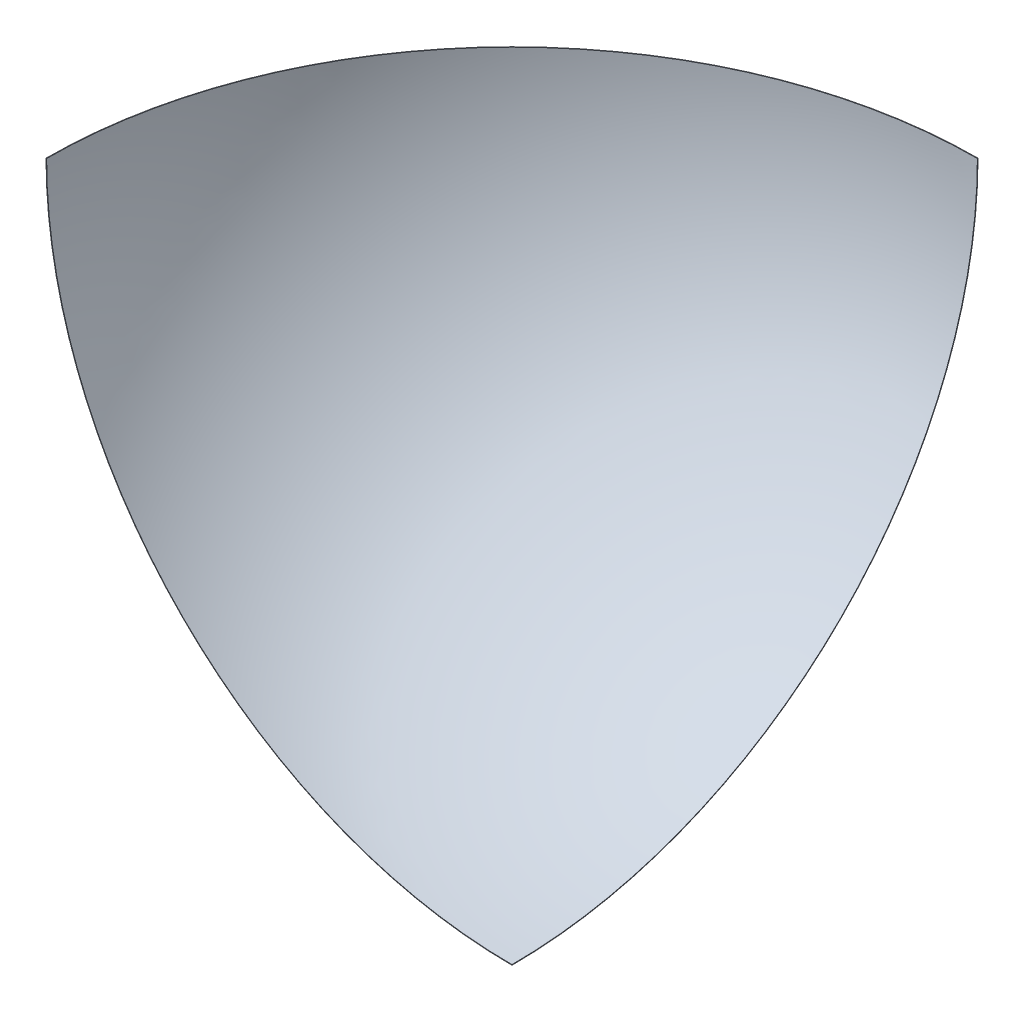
from build123d import *

# Parameters (mm, degrees)
REVOLVE2_ANGLE = 90


with BuildPart() as part:
    # Sketch8 → Revolve2 (revolve)
    with BuildSketch(Plane(origin=(0, 0, 0), x_dir=(-1, 0, 0), z_dir=(0, 1, 0))):
        with BuildLine():
            Line((1222.6925, 0), (1224.28, 0))
            ThreePointArc((1224.28, 0), (865.696690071, -865.696690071), (0, -1224.28))
            Line((0, -1224.28), (0, -1222.6925))
            ThreePointArc((0, -1222.6925), (864.574158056, -864.574158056), (1222.6925, 0))
        make_face()
    revolve(axis=Axis((0, 0, -1224.28), (0, 0, 1)), revolution_arc=REVOLVE2_ANGLE)


solid = part.part
